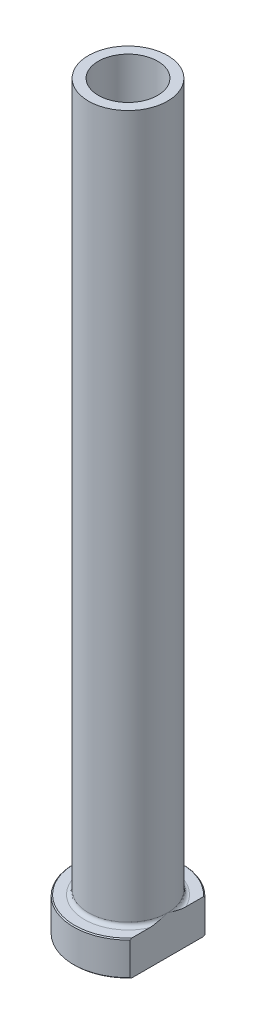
from build123d import *

# Parameters (mm, degrees)
FILLET1_R          = 0.8
CHAMFER1_SIZE      = 0.2
CUT_EXTRUDE1_DEPTH = 151.804509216
CHAMFER2_SIZE      = 0.5


with BuildPart() as part:
    # Sketch1 → Revolve1 (revolve)
    with BuildSketch(Plane.XY, mode=Mode.PRIVATE) as revolve1_sk:
        Polygon((-6, 150), (-8, 150), (-8, 7), (-11, 7), (-11, 0), (-6.25, 0), (-6.25, 83), (-6, 95), align=None)
    revolve(revolve1_sk.sketch.rotate(Axis((0, 92.187680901, 0), (0, -1, 0)), 270), axis=Axis((0, 92.187680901, 0), (0, -1, 0)))

    # Fillet1
    fillet1_edges = [part.edges().sort_by_distance(p)[0] for p in [
        (0, 7, -8),
    ]]
    fillet(fillet1_edges, radius=FILLET1_R)

    # Chamfer1
    chamfer1_edges = [part.edges().sort_by_distance(p)[0] for p in [
        (0, 0, -11),
        (0, 7, -11),
    ]]
    chamfer(chamfer1_edges, length=CHAMFER1_SIZE)

    # Sketch2 → Cut-Extrude1 (cut, through all)
    with BuildSketch(Plane.XZ):
        with BuildLine():
            Line((8, 7.549834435), (8, -7.549834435))
            ThreePointArc((8, -7.549834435), (11, 0), (8, 7.549834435))
        make_face()
    extrude(amount=-CUT_EXTRUDE1_DEPTH, mode=Mode.SUBTRACT)

    # Chamfer2
    chamfer2_edges = [part.edges().sort_by_distance(p)[0] for p in [
        (0, 0, -6.25),
    ]]
    chamfer(chamfer2_edges, length=CHAMFER2_SIZE)


solid = part.part
